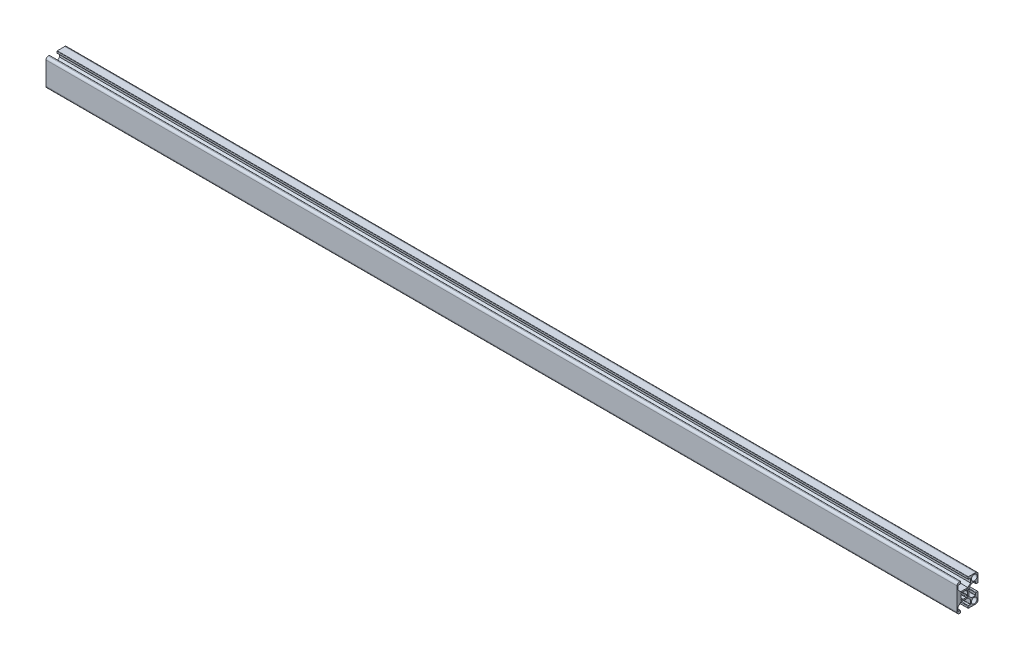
from build123d import *

# Parameters (mm, degrees)
MODEL4_R                        = 3.10000227
MODEL4_R_2                      = 3.10000277
F_30_SARJA_1_0004_23X30_1_DEPTH = 1000


with BuildPart() as part:
    # Model4 → 30-sarja 1.0004 23X30_1 (new body)
    with BuildSketch(Plane(origin=(0, 0, 0), x_dir=(0, 0, -1), z_dir=(1, 0, 0))):
        with BuildLine():
            Line((4.100001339, 14.699999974), (4.100001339, 12.999999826))
            ThreePointArc((4.100001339, 12.999999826), (4.246447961, 12.646446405), (4.600001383, 12.499999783))
            Line((4.600001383, 12.499999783), (6.500001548, 12.499999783))
            ThreePointArc((6.500001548, 12.499999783), (6.712129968, 12.412130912), (6.799995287, 12.200001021))
            Line((6.799995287, 12.200001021), (6.799995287, 7.860653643))
            Line((6.799995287, 7.860653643), (3.939340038, 4.999997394))
            Line((3.939340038, 4.999997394), (-3.939340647, 4.999997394))
            Line((-3.939340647, 4.999997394), (-6.799995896, 7.860653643))
            Line((-6.799995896, 7.860653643), (-6.799995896, 12.20000102))
            ThreePointArc((-6.799995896, 12.20000102), (-6.712128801, 12.412130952), (-6.499998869, 12.499998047))
            Line((-6.499998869, 12.499998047), (-4.599998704, 12.499998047))
            ThreePointArc((-4.599998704, 12.499998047), (-4.246445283, 12.646444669), (-4.099998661, 12.99999809))
            Line((-4.099998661, 12.99999809), (-4.099998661, 14.699998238))
            ThreePointArc((-4.099998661, 14.699998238), (-4.187866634, 14.912130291), (-4.399998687, 14.999998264))
            Line((-4.399998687, 14.999998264), (-5.499999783, 14.999998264))
            ThreePointArc((-5.499999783, 14.999998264), (-7.267765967, 14.267766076), (-8, 12.500000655))
            Line((-8, 12.500000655), (-8, -12.500001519))
            ThreePointArc((-8, -12.500001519), (-7.267766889, -14.267768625), (-5.499999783, -15.000001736))
            Line((-5.499999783, -15.000001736), (-4.399998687, -15.000001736))
            ThreePointArc((-4.399998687, -15.000001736), (-4.187866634, -14.912133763), (-4.099998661, -14.70000171))
            Line((-4.099998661, -14.70000171), (-4.099998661, -13.000001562))
            ThreePointArc((-4.099998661, -13.000001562), (-4.246445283, -12.646448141), (-4.599998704, -12.500001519))
            Line((-4.599998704, -12.500001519), (-6.49999887, -12.500001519))
            ThreePointArc((-6.49999887, -12.500001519), (-6.712128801, -12.412134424), (-6.799995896, -12.200004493))
            Line((-6.799995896, -12.200004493), (-6.799995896, -7.860655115))
            Line((-6.799995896, -7.860655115), (-3.939340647, -5.000000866))
            Line((-3.939340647, -5.000000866), (3.939340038, -5.000000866))
            Line((3.939340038, -5.000000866), (6.799995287, -7.860655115))
            Line((6.799995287, -7.860655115), (6.799995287, -12.200004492))
            ThreePointArc((6.799995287, -12.200004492), (6.712128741, -12.41213214), (6.500001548, -12.499999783))
            Line((6.500001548, -12.499999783), (4.600001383, -12.499999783))
            ThreePointArc((4.600001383, -12.499999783), (4.246447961, -12.646446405), (4.100001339, -12.999999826))
            Line((4.100001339, -12.999999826), (4.100001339, -14.699999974))
            ThreePointArc((4.100001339, -14.699999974), (4.18786815, -14.912130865), (4.399998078, -15))
            Line((4.399998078, -15), (12.499999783, -15))
            ThreePointArc((12.499999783, -15), (14.267766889, -14.267766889), (15, -12.499999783))
            Line((15, -12.499999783), (15, -4.399997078))
            ThreePointArc((15, -4.399997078), (14.912132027, -4.187865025), (14.699999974, -4.099997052))
            Line((14.699999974, -4.099997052), (12.999999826, -4.099997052))
            ThreePointArc((12.999999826, -4.099997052), (12.646446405, -4.246443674), (12.499999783, -4.599997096))
            Line((12.499999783, -4.599997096), (12.499999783, -6.499997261))
            ThreePointArc((12.499999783, -6.499997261), (12.412132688, -6.712127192), (12.200002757, -6.799994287))
            Line((12.200002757, -6.799994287), (7.860655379, -6.799994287))
            Line((7.860655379, -6.799994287), (4.99999913, -3.939339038))
            Line((4.99999913, -3.939339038), (4.99999913, 3.939340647))
            Line((4.99999913, 3.939340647), (7.860655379, 6.799997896))
            Line((7.860655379, 6.799997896), (12.200002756, 6.799997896))
            ThreePointArc((12.200002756, 6.799997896), (12.412132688, 6.712130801), (12.499999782, 6.500000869))
            Line((12.499999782, 6.500000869), (12.499999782, 4.600001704))
            ThreePointArc((12.499999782, 4.600001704), (12.64644686, 4.246449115), (12.999999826, 4.100002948))
            Line((12.999999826, 4.100002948), (14.699999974, 4.100002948))
            ThreePointArc((14.699999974, 4.100002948), (14.912130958, 4.187869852), (15, 4.399999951))
            Line((15, 4.399999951), (15, 12.500000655))
            ThreePointArc((15, 12.500000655), (14.267766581, 14.267767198), (12.499999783, 15))
            Line((12.499999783, 15), (4.399998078, 15))
            ThreePointArc((4.399998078, 15), (4.18786815, 14.912130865), (4.100001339, 14.699999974))
        make_face()
        with Locations((10.899999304, 10.899998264)):
            Circle(MODEL4_R, mode=Mode.SUBTRACT)
        with Locations((10.899999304, -10.900001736)):
            Circle(MODEL4_R_2, mode=Mode.SUBTRACT)
        with BuildLine():
            Line((-3.363290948, -1.949075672), (-3.657286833, -2.243071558))
            Line((-3.657286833, -2.243071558), (-3.878886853, -3.285874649))
            ThreePointArc((-3.878886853, -3.285874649), (-3.743361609, -3.743359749), (-3.285876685, -3.878885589))
            Line((-3.285876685, -3.878885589), (-2.243072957, -3.657285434))
            Line((-2.243072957, -3.657285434), (-1.949077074, -3.363289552))
            ThreePointArc((-1.949077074, -3.363289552), (-1.786690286, -3.279574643), (-1.60585483, -3.305578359))
            ThreePointArc((-1.60585483, -3.305578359), (3.47e-07, -3.67499905), (1.605855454, -3.305578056))
            ThreePointArc((1.605855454, -3.305578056), (1.786690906, -3.279574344), (1.949077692, -3.363289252))
            Line((1.949077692, -3.363289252), (2.243074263, -3.657285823))
            Line((2.243074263, -3.657285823), (3.285877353, -3.878885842))
            ThreePointArc((3.285877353, -3.878885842), (3.743361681, -3.743360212), (3.878887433, -3.28587592))
            Line((3.878887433, -3.28587592), (3.657288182, -2.243071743))
            Line((3.657288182, -2.243071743), (3.363291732, -1.949076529))
            ThreePointArc((3.363291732, -1.949076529), (3.279576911, -1.786689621), (3.305580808, -1.605854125))
            ThreePointArc((3.305580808, -1.605854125), (3.675000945, 1.797e-06), (3.305579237, 1.605857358))
            ThreePointArc((3.305579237, 1.605857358), (3.279575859, 1.78669279), (3.363290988, 1.949079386))
            Line((3.363290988, 1.949079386), (3.65728702, 2.243074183))
            Line((3.65728702, 2.243074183), (3.87888604, 3.285877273))
            ThreePointArc((3.87888604, 3.285877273), (3.743360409, 3.743361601), (3.285876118, 3.878887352))
            Line((3.285876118, 3.878887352), (2.243072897, 3.657288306))
            Line((2.243072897, 3.657288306), (1.949077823, 3.363291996))
            ThreePointArc((1.949077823, 3.363291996), (1.786690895, 3.279576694), (1.605855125, 3.305580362))
            ThreePointArc((1.605855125, 3.305580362), (4.57e-07, 3.675000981), (-1.605854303, 3.305580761))
            ThreePointArc((-1.605854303, 3.305580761), (-1.7866901, 3.279577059), (-1.949077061, 3.363292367))
            Line((-1.949077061, 3.363292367), (-2.243071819, 3.65728836))
            Line((-2.243071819, 3.65728836), (-3.285874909, 3.878887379))
            ThreePointArc((-3.285874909, 3.878887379), (-3.74336001, 3.743362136), (-3.87888585, 3.285877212))
            Line((-3.87888585, 3.285877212), (-3.657285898, 2.24307444))
            Line((-3.657285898, 2.24307444), (-3.3632897, 1.949078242))
            ThreePointArc((-3.3632897, 1.949078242), (-3.279574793, 1.786691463), (-3.305578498, 1.605856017))
            ThreePointArc((-3.305578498, 1.605856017), (-3.674999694, 1.438e-06), (-3.305579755, -1.605853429))
            ThreePointArc((-3.305579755, -1.605853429), (-3.27957604, -1.786688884), (-3.363290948, -1.949075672))
        make_face(mode=Mode.SUBTRACT)
    extrude(amount=F_30_SARJA_1_0004_23X30_1_DEPTH)


solid = part.part
